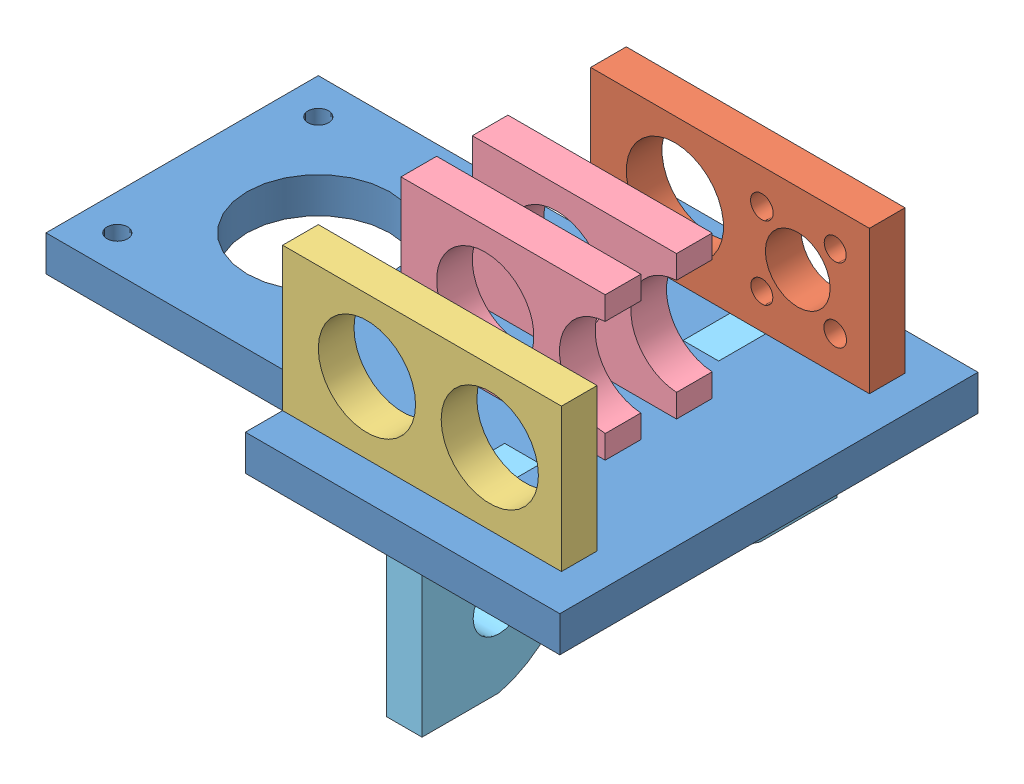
SolidWorks assembly holder2.SLDASM, configuration Default (file format 11000). Lengths in mm.
Overall size (90.5 49.48 64.5).
6 component instances, 5 part files, 17 mates.
Components (placement in the parent):
- nut_holder-1: nut_holder.SLDPRT [Default] at (54.8956 13.2943 81.3787) size (90.5 5.5 64.5)
- screw_holder-1: screw_holder.SLDPRT [Default] at (12.0143 13.2943 28.1287) x (-1 0 0) z (0 -1 0) size (43 5.5 27.6)
- bearing_holder2-1: bearing_holder2.SLDPRT [Default] at (12.0143 13.2943 75.6287) x (-1 0 0) z (0 0 -1) size (43 27.6 5.5)
- bearing_holder1-1: bearing_holder1.SLDPRT [Default] at (28.3058 27.3494 57.3787) x (-1 0 0) z (0 -1 0) size (31.5 5.5 27.6)
- bearing_holder1-2: bearing_holder1.SLDPRT [Default] at (28.3058 27.3494 46.3787) x (-1 0 0) z (0 -1 0) size (31.5 5.5 27.6)
- rod_holder-1: rod_holder.SLDPRT [Default] at (27.8956 18.7943 75.6287) x (1 0 0) z (0 0 -1) size (5.5 27.38 64)
Mates (geometry in assembly coordinates):
- Coincident1: coincident: plane of nut_holder-1 through (54.8956 13.2943 81.3787) normal (0 -1 0); plane of screw_holder-1 through (22.3956 13.2943 22.6287) normal (0 -1 0)
- Coincident2: coincident: plane of nut_holder-1 through (11.8956 18.7943 22.6287) normal (0 0 1); plane of screw_holder-1 through (12.0143 13.2943 22.6287) normal (0 0 -1)
- Coincident3: coincident: line of nut_holder-1 through (49.3956 13.2943 28.1287) axis (0 0 -1); line of screw_holder-1 through (49.3956 13.2943 22.6287) axis (0 0 1)
- Coincident4: coincident: plane of nut_holder-1 through (54.8956 13.2943 81.3787) normal (0 -1 0); plane of bearing_holder2-1 through (49.3956 13.2943 70.1287) normal (0 -1 0)
- Coincident5: coincident: plane of nut_holder-1 through (54.8956 18.7943 81.3787) normal (0 1 0); line of bearing_holder2-1 through (38.8956 18.7943 75.6287) axis (-1 0 0)
- Coincident6: coincident: line of nut_holder-1 through (11.8956 13.2943 75.6287) axis (1 0 0); line of bearing_holder2-1 through (22.3956 13.2943 75.6287) axis (-1 0 0)
- Coincident7: coincident: plane of nut_holder-1 through (49.3956 18.7943 70.1287) normal (-1 0 0); plane of bearing_holder2-1 through (49.3956 40.8943 70.1287) normal (1 0 0)
- Coincident10: coincident: line of nut_holder-1 through (11.8956 13.2943 57.3787) axis (1 0 0); plane of nut_holder-1 through (20.5623 18.7943 57.3787) normal (0 0 -1)
- Coincident16: coincident: plane of nut_holder-1 through (54.8956 13.2943 81.3787) normal (0 -1 0); plane of bearing_holder1-1 through (20.5623 13.2943 51.8787) normal (0 -1 0)
- Coincident17: coincident: line of nut_holder-1 through (37.8956 13.2943 57.3787) axis (0 0 -1); line of bearing_holder1-1 through (37.8956 13.2943 51.8787) axis (0 0 1)
- Coincident18: coincident: line of nut_holder-1 through (20.5623 13.2943 51.8787) axis (-1 0 0); line of bearing_holder1-1 through (20.5623 13.2943 51.8787) axis (-1 0 0)
- Coincident19: coincident: plane of nut_holder-1 through (54.8956 13.2943 81.3787) normal (0 -1 0); plane of bearing_holder1-2 through (37.8956 13.2943 40.8787) normal (0 -1 0)
- Coincident20: coincident: line of nut_holder-1 through (37.8956 13.2943 46.3787) axis (0 0 -1); line of bearing_holder1-2 through (37.8956 13.2943 40.8787) axis (0 0 1)
- Coincident21: coincident: line of nut_holder-1 through (20.5623 13.2943 40.8787) axis (-1 0 0); line of bearing_holder1-2 through (20.5623 13.2943 40.8787) axis (-1 0 0)
- Coincident25: coincident: plane of nut_holder-1 through (54.8956 18.7943 81.3787) normal (0 1 0); plane of rod_holder-1 through (33.3956 18.7943 75.6287) normal (0 1 0)
- Coincident26: coincident: line of nut_holder-1 through (33.3956 18.7943 22.6287) axis (-1 0 0); line of rod_holder-1 through (33.3956 18.7943 22.6287) axis (-1 0 0)
- Coincident27: coincident: line of nut_holder-1 through (27.8956 18.7943 62.8787) axis (0 0 1); line of rod_holder-1 through (27.8956 18.7943 62.8787) axis (0 0 1)
